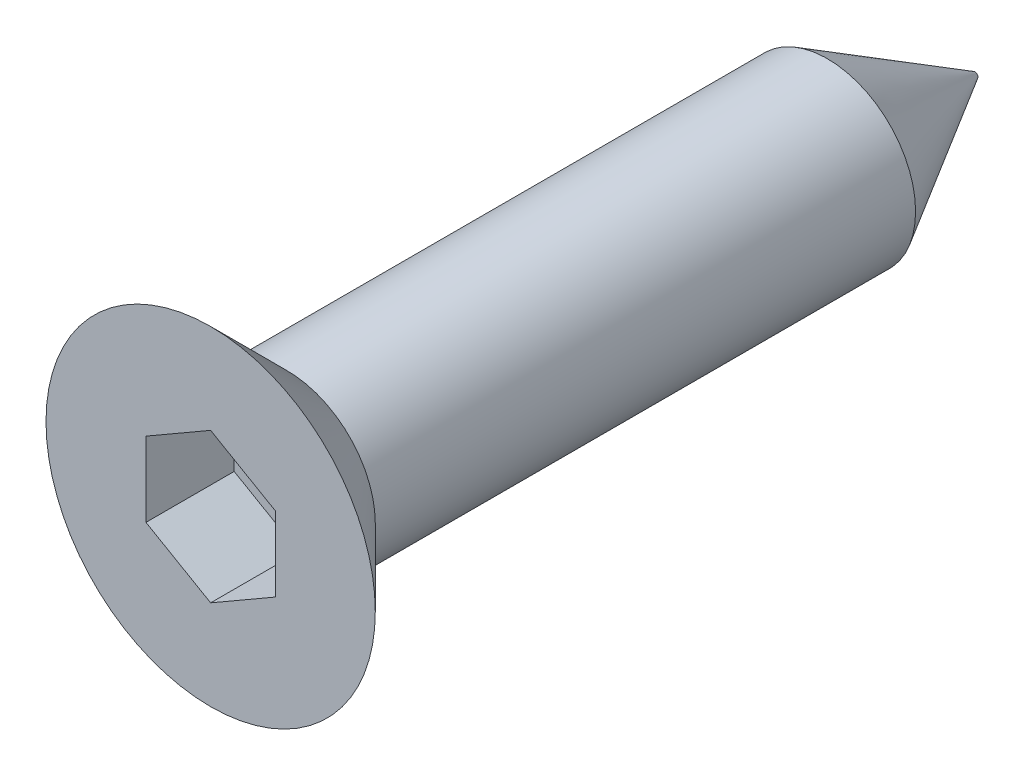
from build123d import *

# Parameters (mm, degrees)
ESQUISSE3_R             = 1.5
EXTRUSION1_DEPTH        = 13
ENL_V_MAT_EXTRU_2_DEPTH = 1.5
CHANFREIN1_SIZE         = 1.45
CHANFREIN1_SIZE2        = 2.511473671


with BuildPart() as part:
    # Esquisse1 → R_volution2 (revolve)
    with BuildSketch(Plane(origin=(0, 0, 0), x_dir=(0, 0, -1), z_dir=(1, 0, 0)), mode=Mode.PRIVATE) as r_volution2_sk:
        Polygon((0, 2.8), (1.3, 1.5), (1.3, 0), (0, 0), align=None)
    revolve(r_volution2_sk.sketch.rotate(Axis((0, 0, 1.603508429), (0, 0, -1)), 90), axis=Axis((0, 0, 1.603508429), (0, 0, -1)))

    # Esquisse3 → Extrusion1 (add)
    with BuildSketch(Plane.XY):
        Circle(ESQUISSE3_R)
    extrude(amount=-EXTRUSION1_DEPTH)

    # Esquisse2 → Enl_v. mat.-Extru.2 (cut)
    with BuildSketch(Plane.XY):
        Polygon((0, 1.270170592), (-1.1, 0.635085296), (-1.1, -0.635085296), (0, -1.270170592), (1.1, -0.635085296), (1.1, 0.635085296), align=None)
    extrude(amount=-ENL_V_MAT_EXTRU_2_DEPTH, mode=Mode.SUBTRACT)

    # Chanfrein1
    chanfrein1_edges = [part.edges().sort_by_distance(p)[0] for p in [
        (-1.5, 0, -13),
    ]]
    chanfrein1_side = [part.faces().sort_by_distance(p)[0] for p in [
        (0, 0, -13),
    ]]
    chamfer(chanfrein1_edges, length=CHANFREIN1_SIZE, length2=CHANFREIN1_SIZE2, reference=chanfrein1_side[0])


solid = part.part
